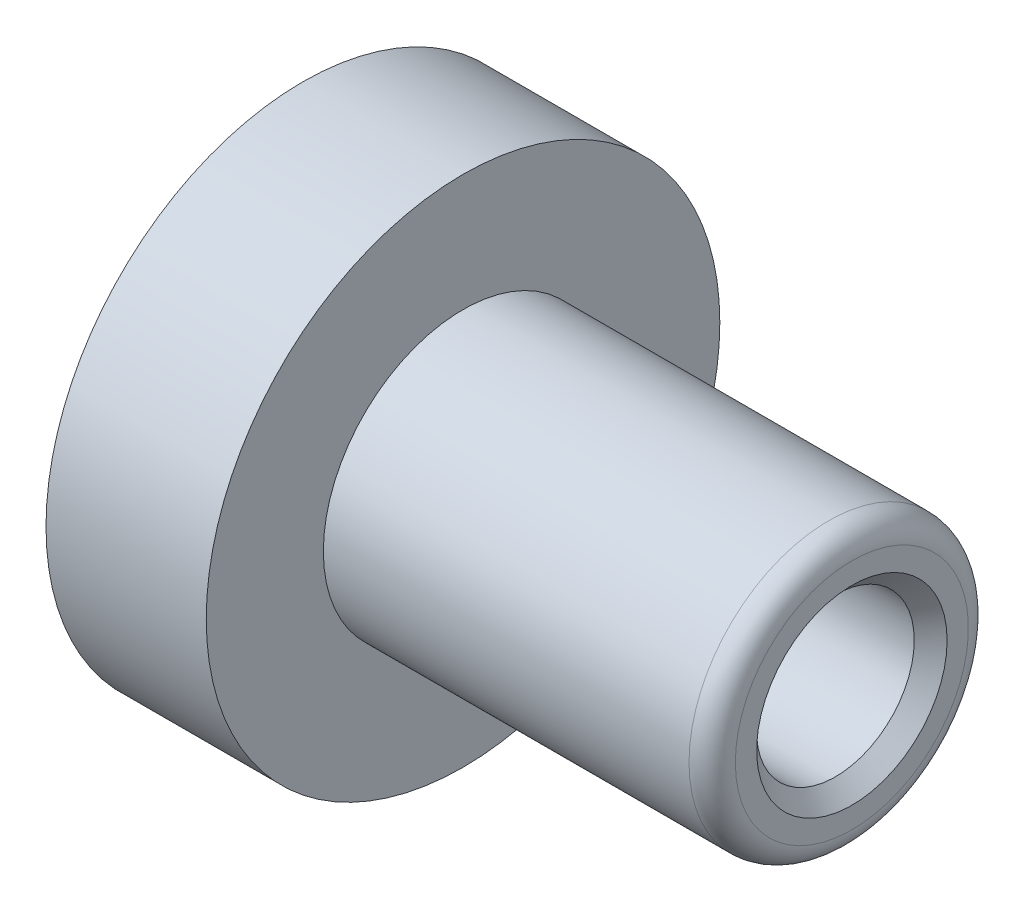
from build123d import *

# Parameters (mm, degrees)
SKETCH2_R          = 1.6129
CUT_EXTRUDE1_DEPTH = 6.35
SKETCH3_R          = 5.3594
CUT_EXTRUDE2_DEPTH = 45.766103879
CHAMFER1_SIZE      = 1.1176


with BuildPart() as part:
    # Sketch1 → Revolve1 (revolve)
    with BuildSketch(Plane.XY, mode=Mode.PRIVATE) as revolve1_sk:
        with BuildLine():
            Line((0, 6.7437), (0, 17.4625))
            Line((0, 17.4625), (10.8966, 17.4625))
            Line((10.8966, 17.4625), (10.8966, 9.4996))
            Line((10.8966, 9.4996), (35.7632, 9.4996))
            ThreePointArc((35.7632, 9.4996), (36.876751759, 9.038351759), (37.338, 7.9248))
            Line((37.338, 7.9248), (37.338, 0))
            Line((37.338, 0), (20.447, 0))
            Line((20.447, 0), (20.447, 6.7437))
            Line((20.447, 6.7437), (0, 6.7437))
        make_face()
    revolve(revolve1_sk.sketch.rotate(Axis((0, 0, 0), (1, 0, 0)), 90), axis=Axis((0, 0, 0), (1, 0, 0)))

    # Sketch2 → Cut-Extrude1 (cut)
    with BuildSketch(Plane.ZY):
        with Locations((-11.1125, 0)):
            Circle(SKETCH2_R)
        with Locations(Location((11.1125, 0, 0), (0, 0, 180))):
            Circle(SKETCH2_R)
    extrude(amount=-CUT_EXTRUDE1_DEPTH, mode=Mode.SUBTRACT)

    # Sketch3 → Cut-Extrude2 (cut, through all)
    with BuildSketch(Plane(origin=(37.338, 0, 0), x_dir=(0, 0, -1), z_dir=(1, 0, 0))):
        Circle(SKETCH3_R)
    extrude(amount=-CUT_EXTRUDE2_DEPTH, mode=Mode.SUBTRACT)

    # Chamfer1
    chamfer1_edges = [part.edges().sort_by_distance(p)[0] for p in [
        (37.338, 0, 5.3594),
    ]]
    chamfer(chamfer1_edges, length=CHAMFER1_SIZE)


solid = part.part
